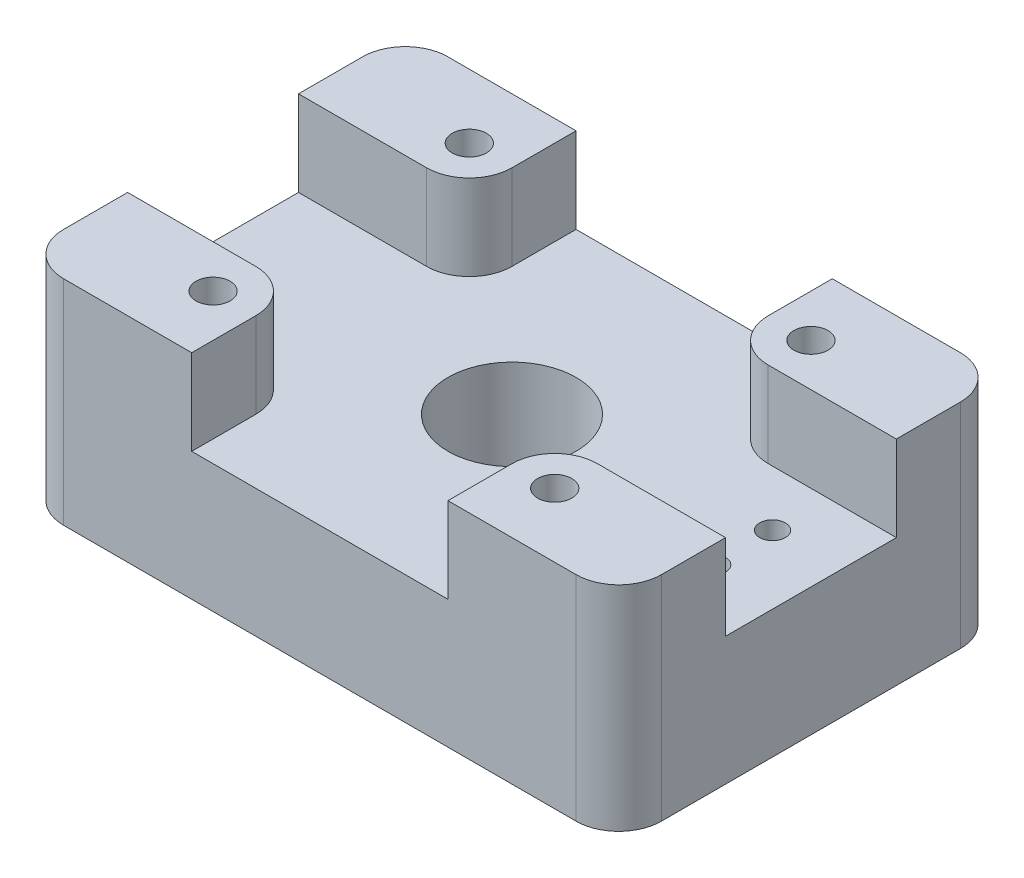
from build123d import *

# Parameters (mm, degrees)
SKETCH_1_W          = 140
SKETCH_1_H          = 90
SKETCH_1_R          = 15
EXTRUDE_1_DEPTH     = 30
EXTRUDE_2_DEPTH     = 20
SKETCH_3_W          = 124
SKETCH_3_H          = 74
SKETCH_3_R          = 22.5
CUT_EXTRUDE_1_DEPTH = 10
SKETCH_4_R          = 4
SKETCH_4_R_2        = 3
CUT_EXTRUDE_2_DEPTH = 98.082439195
FILLET_1_R          = 10


with BuildPart() as part:
    # Sketch 1 → Extrude 1 (new body)
    with BuildSketch(Plane(origin=(0, 0, 0), x_dir=(1, 0, 0), z_dir=(0, 1, 0))):
        Rectangle(SKETCH_1_W, SKETCH_1_H)
        with Locations(Location((0, 0, 0), (0, 0, 270))):
            Circle(SKETCH_1_R, mode=Mode.SUBTRACT)
    extrude(amount=EXTRUDE_1_DEPTH)

    # Sketch 2 → Extrude 2 (add)
    with BuildSketch(Plane(origin=(0, 30, 0), x_dir=(1, 0, 0), z_dir=(0, 1, 0))):
        with BuildLine():
            Line((-30, 45), (-30, 30))
            ThreePointArc((-30, 30), (-32.928932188, 22.928932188), (-40, 20))
            Line((-40, 20), (-70, 20))
            Line((-70, 20), (-70, 45))
            Line((-70, 45), (-30, 45))
        make_face()
        with BuildLine():
            Line((-70, -20), (-70, -45))
            Line((-70, -45), (-30, -45))
            Line((-30, -45), (-30, -30))
            ThreePointArc((-30, -30), (-32.928932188, -22.928932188), (-40, -20))
            Line((-40, -20), (-70, -20))
        make_face()
        with BuildLine():
            Line((70, -20), (70, -45))
            Line((70, -45), (30, -45))
            Line((30, -45), (30, -30))
            ThreePointArc((30, -30), (32.928932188, -22.928932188), (40, -20))
            Line((40, -20), (70, -20))
        make_face()
        with BuildLine():
            Line((70, 20), (70, 45))
            Line((70, 45), (30, 45))
            Line((30, 45), (30, 30))
            ThreePointArc((30, 30), (32.928932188, 22.928932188), (40, 20))
            Line((40, 20), (70, 20))
        make_face()
    extrude(amount=EXTRUDE_2_DEPTH)

    # Sketch 3 → Cut-Extrude 1 (cut)
    with BuildSketch(Plane.XZ):
        Rectangle(SKETCH_3_W, SKETCH_3_H)
        with Locations(Location((0, 0, 0), (0, 0, 270))):
            Circle(SKETCH_3_R, mode=Mode.SUBTRACT)
    extrude(amount=-CUT_EXTRUDE_1_DEPTH, mode=Mode.SUBTRACT)

    # Sketch 4 → Cut-Extrude 2 (cut, through all)
    with BuildSketch(Plane(origin=(0, 50, 0), x_dir=(1, 0, 0), z_dir=(0, 1, 0))):
        with Locations(Location((-40, 30, 0), (0, 0, 270))):
            Circle(SKETCH_4_R)
        with Locations(Location((-40, -30, 0), (0, 0, 270))):
            Circle(SKETCH_4_R)
        with Locations(Location((40, -30, 0), (0, 0, 270))):
            Circle(SKETCH_4_R)
        with Locations(Location((40, 30, 0), (0, 0, 270))):
            Circle(SKETCH_4_R)
        with Locations(Location((54, 7, 0), (0, 0, 270))):
            Circle(SKETCH_4_R_2)
        with Locations(Location((54, -7, 0), (0, 0, 270))):
            Circle(SKETCH_4_R_2)
    extrude(amount=-CUT_EXTRUDE_2_DEPTH, mode=Mode.SUBTRACT)

    # Fillet 1
    fillet_1_edges = [part.edges().sort_by_distance(p)[0] for p in [
        (-70, 25, -45),
        (70, 25, -45),
        (70, 25, 45),
        (-70, 25, 45),
    ]]
    fillet(fillet_1_edges, radius=FILLET_1_R)


solid = part.part
